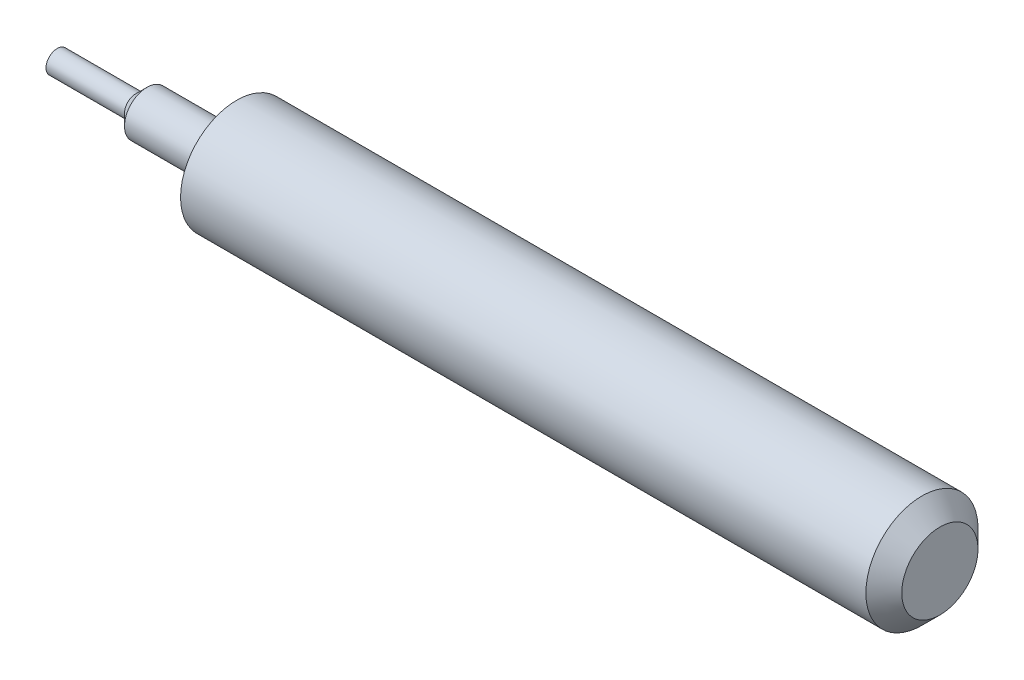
from build123d import *

# Parameters (mm, degrees)
CHAMFER1_SIZE = 2.54


with BuildPart() as part:
    # Sketch1 → Revolve1 (revolve)
    with BuildSketch(Plane(origin=(0, 0, 0), x_dir=(1, 0, 0), z_dir=(0, 1, 0)), mode=Mode.PRIVATE) as revolve1_sk:
        Polygon((0, 3.175), (0, 7.9375), (99.568, 7.9375), (99.568, 0), (0, 0), (-25.4, 0), (-25.4, 1.5875), (-14.2875, 1.5875), (-12.7, 3.175), align=None)
    revolve(revolve1_sk.sketch.rotate(Axis((-1000, 0, 0), (1, 0, 0)), 180), axis=Axis((-1000, 0, 0), (1, 0, 0)))

    # Chamfer1
    chamfer1_edges = [part.edges().sort_by_distance(p)[0] for p in [
        (99.568, 0, -7.9375),
    ]]
    chamfer(chamfer1_edges, length=CHAMFER1_SIZE)


solid = part.part
